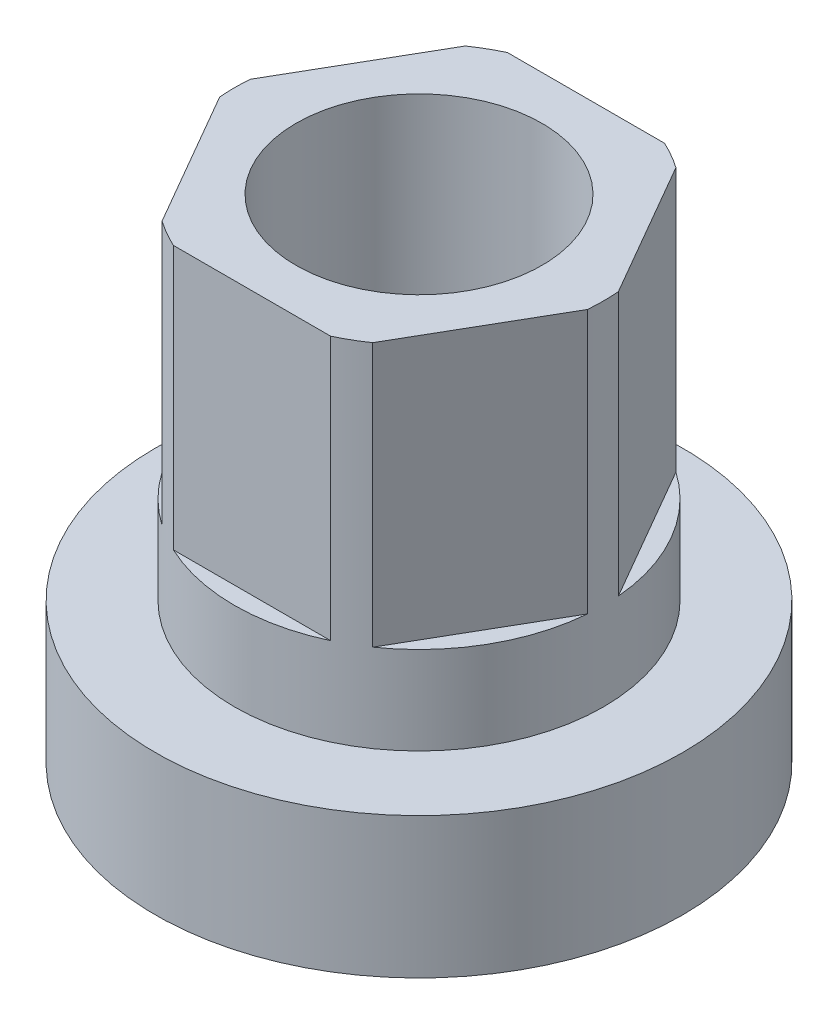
ISO-10303-21;
HEADER;
FILE_DESCRIPTION(('STEP AP214'),'2;1');
FILE_NAME('part.step','',(''),(''),'','','');
FILE_SCHEMA(('AUTOMOTIVE_DESIGN { 1 0 10303 214 1 1 1 1 }'));
ENDSEC;
DATA;
#1=APPLICATION_CONTEXT('core data for automotive mechanical design processes');
#2=APPLICATION_PROTOCOL_DEFINITION('international standard','automotive_design',2000,#1);
#3=PRODUCT_CONTEXT('',#1,'mechanical');
#4=PRODUCT('Part','Part','',(#3));
#5=PRODUCT_RELATED_PRODUCT_CATEGORY('part','',(#4));
#6=PRODUCT_DEFINITION_FORMATION('','',#4);
#7=PRODUCT_DEFINITION_CONTEXT('part definition',#1,'design');
#8=PRODUCT_DEFINITION('design','',#6,#7);
#9=PRODUCT_DEFINITION_SHAPE('','',#8);
#10=(LENGTH_UNIT() NAMED_UNIT(*) SI_UNIT(.MILLI.,.METRE.));
#11=(NAMED_UNIT(*) PLANE_ANGLE_UNIT() SI_UNIT($,.RADIAN.));
#12=(NAMED_UNIT(*) SI_UNIT($,.STERADIAN.) SOLID_ANGLE_UNIT());
#13=UNCERTAINTY_MEASURE_WITH_UNIT(LENGTH_MEASURE(1.E-05),#10,'distance_accuracy_value','');
#14=(GEOMETRIC_REPRESENTATION_CONTEXT(3) GLOBAL_UNCERTAINTY_ASSIGNED_CONTEXT((#13)) GLOBAL_UNIT_ASSIGNED_CONTEXT((#10,
#11,#12)) REPRESENTATION_CONTEXT('',''));
#15=CARTESIAN_POINT('',(0.,0.,0.));
#16=DIRECTION('',(0.,0.,1.));
#17=DIRECTION('',(1.,0.,0.));
#18=AXIS2_PLACEMENT_3D('',#15,#16,#17);
#19=CARTESIAN_POINT('',(7.00000000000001,28.,0.));
#20=DIRECTION('',(0.,-1.,0.));
#21=DIRECTION('',(1.,0.,0.));
#22=AXIS2_PLACEMENT_3D('',#19,#20,#21);
#23=PLANE('',#22);
#24=CARTESIAN_POINT('',(0.,28.,0.));
#25=DIRECTION('',(0.,1.,0.));
#26=DIRECTION('',(-1.,0.,0.));
#27=AXIS2_PLACEMENT_3D('',#24,#25,#26);
#28=CIRCLE('',#27,7.);
#29=CARTESIAN_POINT('',(-7.00000000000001,28.,0.));
#30=VERTEX_POINT('',#29);
#31=EDGE_CURVE('E183',#30,#30,#28,.T.);
#32=ORIENTED_EDGE('',*,*,#31,.F.);
#33=EDGE_LOOP('',(#32));
#34=FACE_BOUND('',#33,.T.);
#35=DIRECTION('',(1.,0.,0.));
#36=VECTOR('',#35,1.);
#37=CARTESIAN_POINT('',(-5.48482755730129,28.,9.50000000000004));
#38=LINE('',#37,#36);
#39=CARTESIAN_POINT('',(-4.47213595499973,28.,9.5000000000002));
#40=VERTEX_POINT('',#39);
#41=CARTESIAN_POINT('',(4.47213595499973,28.,9.50000000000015));
#42=VERTEX_POINT('',#41);
#43=EDGE_CURVE('E159',#40,#42,#38,.T.);
#44=ORIENTED_EDGE('',*,*,#43,.T.);
#45=CARTESIAN_POINT('',(0.,28.,0.));
#46=DIRECTION('',(0.,1.,0.));
#47=DIRECTION('',(-1.,0.,0.));
#48=AXIS2_PLACEMENT_3D('',#45,#46,#47);
#49=CIRCLE('',#48,10.5);
#50=CARTESIAN_POINT('',(5.99117335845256,28.,8.62298334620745));
#51=VERTEX_POINT('',#50);
#52=EDGE_CURVE('E157',#42,#51,#49,.T.);
#53=ORIENTED_EDGE('',*,*,#52,.T.);
#54=DIRECTION('',(0.500000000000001,0.,-0.86602540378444));
#55=VECTOR('',#54,1.);
#56=CARTESIAN_POINT('',(5.48482755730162,28.,9.50000000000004));
#57=LINE('',#56,#55);
#58=CARTESIAN_POINT('',(10.4633093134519,28.,0.877016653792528));
#59=VERTEX_POINT('',#58);
#60=EDGE_CURVE('E140',#51,#59,#57,.T.);
#61=ORIENTED_EDGE('',*,*,#60,.T.);
#62=CARTESIAN_POINT('',(10.4633093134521,28.,-0.877016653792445));
#63=VERTEX_POINT('',#62);
#64=EDGE_CURVE('E155',#59,#63,#49,.T.);
#65=ORIENTED_EDGE('',*,*,#64,.T.);
#66=DIRECTION('',(-0.500000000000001,0.,-0.86602540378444));
#67=VECTOR('',#66,1.);
#68=CARTESIAN_POINT('',(10.9696551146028,28.,0.));
#69=LINE('',#68,#67);
#70=CARTESIAN_POINT('',(5.99117335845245,28.,-8.62298334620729));
#71=VERTEX_POINT('',#70);
#72=EDGE_CURVE('E158',#63,#71,#69,.T.);
#73=ORIENTED_EDGE('',*,*,#72,.T.);
#74=CARTESIAN_POINT('',(4.47213595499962,28.,-9.50000000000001));
#75=VERTEX_POINT('',#74);
#76=EDGE_CURVE('E165',#71,#75,#49,.T.);
#77=ORIENTED_EDGE('',*,*,#76,.T.);
#78=DIRECTION('',(-1.,0.,0.));
#79=VECTOR('',#78,1.);
#80=CARTESIAN_POINT('',(5.48482755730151,28.,-9.50000000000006));
#81=LINE('',#80,#79);
#82=CARTESIAN_POINT('',(-4.47213595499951,28.,-9.50000000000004));
#83=VERTEX_POINT('',#82);
#84=EDGE_CURVE('E72',#75,#83,#81,.T.);
#85=ORIENTED_EDGE('',*,*,#84,.T.);
#86=CARTESIAN_POINT('',(-5.99117335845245,28.,-8.62298334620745));
#87=VERTEX_POINT('',#86);
#88=EDGE_CURVE('E169',#83,#87,#49,.T.);
#89=ORIENTED_EDGE('',*,*,#88,.T.);
#90=DIRECTION('',(-0.500000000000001,0.,0.86602540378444));
#91=VECTOR('',#90,1.);
#92=CARTESIAN_POINT('',(-5.48482755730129,28.,-9.4999999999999));
#93=LINE('',#92,#91);
#94=CARTESIAN_POINT('',(-10.4633093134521,28.,-0.877016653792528));
#95=VERTEX_POINT('',#94);
#96=EDGE_CURVE('E64',#87,#95,#93,.T.);
#97=ORIENTED_EDGE('',*,*,#96,.T.);
#98=CARTESIAN_POINT('',(-10.4633093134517,28.,0.877016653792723));
#99=VERTEX_POINT('',#98);
#100=EDGE_CURVE('E170',#95,#99,#49,.T.);
#101=ORIENTED_EDGE('',*,*,#100,.T.);
#102=DIRECTION('',(0.500000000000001,0.,0.86602540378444));
#103=VECTOR('',#102,1.);
#104=CARTESIAN_POINT('',(-10.9696551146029,28.,0.));
#105=LINE('',#104,#103);
#106=CARTESIAN_POINT('',(-5.99117335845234,28.,8.6229833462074));
#107=VERTEX_POINT('',#106);
#108=EDGE_CURVE('E175',#99,#107,#105,.T.);
#109=ORIENTED_EDGE('',*,*,#108,.T.);
#110=EDGE_CURVE('E167',#107,#40,#49,.T.);
#111=ORIENTED_EDGE('',*,*,#110,.T.);
#112=EDGE_LOOP('',(#44,#53,#61,#65,#73,#77,#85,#89,#97,#101,#109,#111));
#113=FACE_BOUND('',#112,.T.);
#114=ADVANCED_FACE('F49',(#34,#113),#23,.F.);
#115=CARTESIAN_POINT('',(0.,43.6484556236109,0.));
#116=DIRECTION('',(0.,1.,0.));
#117=DIRECTION('',(-1.,0.,0.));
#118=AXIS2_PLACEMENT_3D('',#115,#116,#117);
#119=CYLINDRICAL_SURFACE('',#118,10.5);
#120=CARTESIAN_POINT('',(0.,8.00000000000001,0.));
#121=DIRECTION('',(0.,1.,0.));
#122=DIRECTION('',(-1.,0.,0.));
#123=AXIS2_PLACEMENT_3D('',#120,#121,#122);
#124=CIRCLE('',#123,10.5);
#125=CARTESIAN_POINT('',(-10.5,8.00000000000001,0.));
#126=VERTEX_POINT('',#125);
#127=EDGE_CURVE('E180',#126,#126,#124,.T.);
#128=ORIENTED_EDGE('',*,*,#127,.T.);
#129=EDGE_LOOP('',(#128));
#130=FACE_BOUND('',#129,.T.);
#131=DIRECTION('',(0.,1.,0.));
#132=VECTOR('',#131,1.);
#133=CARTESIAN_POINT('',(4.47213595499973,43.6484556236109,9.50000000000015));
#134=LINE('',#133,#132);
#135=CARTESIAN_POINT('',(4.47213595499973,13.,9.50000000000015));
#136=VERTEX_POINT('',#135);
#137=EDGE_CURVE('E14',#136,#42,#134,.T.);
#138=ORIENTED_EDGE('',*,*,#137,.F.);
#139=CARTESIAN_POINT('',(0.,13.,0.));
#140=DIRECTION('',(0.,1.,0.));
#141=DIRECTION('',(-1.,0.,0.));
#142=AXIS2_PLACEMENT_3D('',#139,#140,#141);
#143=CIRCLE('',#142,10.5);
#144=CARTESIAN_POINT('',(-4.47213595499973,13.,9.5000000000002));
#145=VERTEX_POINT('',#144);
#146=EDGE_CURVE('E57',#145,#136,#143,.T.);
#147=ORIENTED_EDGE('',*,*,#146,.F.);
#148=DIRECTION('',(0.,1.,0.));
#149=VECTOR('',#148,1.);
#150=CARTESIAN_POINT('',(-4.47213595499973,43.6484556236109,9.50000000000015));
#151=LINE('',#150,#149);
#152=EDGE_CURVE('E213',#40,#145,#151,.F.);
#153=ORIENTED_EDGE('',*,*,#152,.F.);
#154=ORIENTED_EDGE('',*,*,#110,.F.);
#155=DIRECTION('',(0.,1.,0.));
#156=VECTOR('',#155,1.);
#157=CARTESIAN_POINT('',(-5.99117335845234,43.6484556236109,8.62298334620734));
#158=LINE('',#157,#156);
#159=CARTESIAN_POINT('',(-5.99117335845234,13.,8.6229833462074));
#160=VERTEX_POINT('',#159);
#161=EDGE_CURVE('E212',#160,#107,#158,.T.);
#162=ORIENTED_EDGE('',*,*,#161,.F.);
#163=CARTESIAN_POINT('',(-10.4633093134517,13.,0.877016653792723));
#164=VERTEX_POINT('',#163);
#165=EDGE_CURVE('E211',#164,#160,#143,.T.);
#166=ORIENTED_EDGE('',*,*,#165,.F.);
#167=DIRECTION('',(0.,1.,0.));
#168=VECTOR('',#167,1.);
#169=CARTESIAN_POINT('',(-10.4633093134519,43.6484556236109,0.877016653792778));
#170=LINE('',#169,#168);
#171=EDGE_CURVE('E209',#99,#164,#170,.F.);
#172=ORIENTED_EDGE('',*,*,#171,.F.);
#173=ORIENTED_EDGE('',*,*,#100,.F.);
#174=DIRECTION('',(0.,1.,0.));
#175=VECTOR('',#174,1.);
#176=CARTESIAN_POINT('',(-10.4633093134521,43.6484556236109,-0.877016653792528));
#177=LINE('',#176,#175);
#178=CARTESIAN_POINT('',(-10.4633093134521,13.,-0.877016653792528));
#179=VERTEX_POINT('',#178);
#180=EDGE_CURVE('E207',#179,#95,#177,.T.);
#181=ORIENTED_EDGE('',*,*,#180,.F.);
#182=CARTESIAN_POINT('',(-5.99117335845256,13.,-8.62298334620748));
#183=VERTEX_POINT('',#182);
#184=EDGE_CURVE('E206',#183,#179,#143,.T.);
#185=ORIENTED_EDGE('',*,*,#184,.F.);
#186=DIRECTION('',(0.,1.,0.));
#187=VECTOR('',#186,1.);
#188=CARTESIAN_POINT('',(-5.99117335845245,43.6484556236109,-8.62298334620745));
#189=LINE('',#188,#187);
#190=EDGE_CURVE('E204',#87,#183,#189,.F.);
#191=ORIENTED_EDGE('',*,*,#190,.F.);
#192=ORIENTED_EDGE('',*,*,#88,.F.);
#193=DIRECTION('',(0.,1.,0.));
#194=VECTOR('',#193,1.);
#195=CARTESIAN_POINT('',(-4.47213595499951,43.6484556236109,-9.50000000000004));
#196=LINE('',#195,#194);
#197=CARTESIAN_POINT('',(-4.47213595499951,13.,-9.50000000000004));
#198=VERTEX_POINT('',#197);
#199=EDGE_CURVE('E202',#198,#83,#196,.T.);
#200=ORIENTED_EDGE('',*,*,#199,.F.);
#201=CARTESIAN_POINT('',(4.47213595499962,13.,-9.50000000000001));
#202=VERTEX_POINT('',#201);
#203=EDGE_CURVE('E201',#202,#198,#143,.T.);
#204=ORIENTED_EDGE('',*,*,#203,.F.);
#205=DIRECTION('',(0.,1.,0.));
#206=VECTOR('',#205,1.);
#207=CARTESIAN_POINT('',(4.47213595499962,43.6484556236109,-9.50000000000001));
#208=LINE('',#207,#206);
#209=EDGE_CURVE('E199',#75,#202,#208,.F.);
#210=ORIENTED_EDGE('',*,*,#209,.F.);
#211=ORIENTED_EDGE('',*,*,#76,.F.);
#212=DIRECTION('',(0.,1.,0.));
#213=VECTOR('',#212,1.);
#214=CARTESIAN_POINT('',(5.99117335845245,43.6484556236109,-8.62298334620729));
#215=LINE('',#214,#213);
#216=CARTESIAN_POINT('',(5.99117335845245,13.,-8.62298334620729));
#217=VERTEX_POINT('',#216);
#218=EDGE_CURVE('E197',#217,#71,#215,.T.);
#219=ORIENTED_EDGE('',*,*,#218,.F.);
#220=CARTESIAN_POINT('',(10.4633093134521,13.,-0.877016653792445));
#221=VERTEX_POINT('',#220);
#222=EDGE_CURVE('E194',#221,#217,#143,.T.);
#223=ORIENTED_EDGE('',*,*,#222,.F.);
#224=DIRECTION('',(0.,1.,0.));
#225=VECTOR('',#224,1.);
#226=CARTESIAN_POINT('',(10.4633093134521,43.6484556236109,-0.877016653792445));
#227=LINE('',#226,#225);
#228=EDGE_CURVE('E147',#63,#221,#227,.F.);
#229=ORIENTED_EDGE('',*,*,#228,.F.);
#230=ORIENTED_EDGE('',*,*,#64,.F.);
#231=DIRECTION('',(0.,1.,0.));
#232=VECTOR('',#231,1.);
#233=CARTESIAN_POINT('',(10.4633093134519,43.6484556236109,0.877016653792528));
#234=LINE('',#233,#232);
#235=CARTESIAN_POINT('',(10.4633093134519,13.,0.877016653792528));
#236=VERTEX_POINT('',#235);
#237=EDGE_CURVE('E137',#236,#59,#234,.T.);
#238=ORIENTED_EDGE('',*,*,#237,.F.);
#239=CARTESIAN_POINT('',(5.99117335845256,13.,8.62298334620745));
#240=VERTEX_POINT('',#239);
#241=EDGE_CURVE('E148',#240,#236,#143,.T.);
#242=ORIENTED_EDGE('',*,*,#241,.F.);
#243=DIRECTION('',(0.,1.,0.));
#244=VECTOR('',#243,1.);
#245=CARTESIAN_POINT('',(5.99117335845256,43.6484556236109,8.62298334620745));
#246=LINE('',#245,#244);
#247=EDGE_CURVE('E192',#51,#240,#246,.F.);
#248=ORIENTED_EDGE('',*,*,#247,.F.);
#249=ORIENTED_EDGE('',*,*,#52,.F.);
#250=EDGE_LOOP('',(#138,#147,#153,#154,#162,#166,#172,#173,#181,#185,#191,#192,#200,#204,#210,
#211,#219,#223,#229,#230,#238,#242,#248,#249));
#251=FACE_BOUND('',#250,.T.);
#252=ADVANCED_FACE('F163',(#130,#251),#119,.T.);
#253=CARTESIAN_POINT('',(0.,66.1332339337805,0.));
#254=DIRECTION('',(0.,1.,0.));
#255=DIRECTION('',(-1.,0.,0.));
#256=AXIS2_PLACEMENT_3D('',#253,#254,#255);
#257=CYLINDRICAL_SURFACE('',#256,7.);
#258=CARTESIAN_POINT('',(0.,0.,0.));
#259=DIRECTION('',(0.,1.,0.));
#260=DIRECTION('',(-1.,0.,0.));
#261=AXIS2_PLACEMENT_3D('',#258,#259,#260);
#262=CIRCLE('',#261,7.);
#263=CARTESIAN_POINT('',(-7.00000000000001,0.,0.));
#264=VERTEX_POINT('',#263);
#265=EDGE_CURVE('E189',#264,#264,#262,.T.);
#266=ORIENTED_EDGE('',*,*,#265,.F.);
#267=EDGE_LOOP('',(#266));
#268=FACE_BOUND('',#267,.T.);
#269=ORIENTED_EDGE('',*,*,#31,.T.);
#270=EDGE_LOOP('',(#269));
#271=FACE_BOUND('',#270,.T.);
#272=ADVANCED_FACE('F51',(#268,#271),#257,.F.);
#273=CARTESIAN_POINT('',(7.00000000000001,0.,0.));
#274=DIRECTION('',(0.,1.,0.));
#275=DIRECTION('',(-1.,0.,0.));
#276=AXIS2_PLACEMENT_3D('',#273,#274,#275);
#277=PLANE('',#276);
#278=CARTESIAN_POINT('',(0.,0.,0.));
#279=DIRECTION('',(0.,1.,0.));
#280=DIRECTION('',(-1.,0.,0.));
#281=AXIS2_PLACEMENT_3D('',#278,#279,#280);
#282=CIRCLE('',#281,15.);
#283=CARTESIAN_POINT('',(-15.,0.,0.));
#284=VERTEX_POINT('',#283);
#285=EDGE_CURVE('E186',#284,#284,#282,.T.);
#286=ORIENTED_EDGE('',*,*,#285,.F.);
#287=EDGE_LOOP('',(#286));
#288=FACE_BOUND('',#287,.T.);
#289=ORIENTED_EDGE('',*,*,#265,.T.);
#290=EDGE_LOOP('',(#289));
#291=FACE_BOUND('',#290,.T.);
#292=ADVANCED_FACE('F291',(#288,#291),#277,.F.);
#293=CARTESIAN_POINT('',(0.,66.1332339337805,0.));
#294=DIRECTION('',(0.,1.,0.));
#295=DIRECTION('',(-1.,0.,0.));
#296=AXIS2_PLACEMENT_3D('',#293,#294,#295);
#297=CYLINDRICAL_SURFACE('',#296,15.);
#298=CARTESIAN_POINT('',(0.,8.00000000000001,0.));
#299=DIRECTION('',(0.,1.,0.));
#300=DIRECTION('',(-1.,0.,0.));
#301=AXIS2_PLACEMENT_3D('',#298,#299,#300);
#302=CIRCLE('',#301,15.);
#303=CARTESIAN_POINT('',(-15.,8.00000000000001,0.));
#304=VERTEX_POINT('',#303);
#305=EDGE_CURVE('E177',#304,#304,#302,.T.);
#306=ORIENTED_EDGE('',*,*,#305,.F.);
#307=EDGE_LOOP('',(#306));
#308=FACE_BOUND('',#307,.T.);
#309=ORIENTED_EDGE('',*,*,#285,.T.);
#310=EDGE_LOOP('',(#309));
#311=FACE_BOUND('',#310,.T.);
#312=ADVANCED_FACE('F289',(#308,#311),#297,.T.);
#313=CARTESIAN_POINT('',(-10.5,8.00000000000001,0.));
#314=DIRECTION('',(0.,-1.,0.));
#315=DIRECTION('',(1.,0.,0.));
#316=AXIS2_PLACEMENT_3D('',#313,#314,#315);
#317=PLANE('',#316);
#318=ORIENTED_EDGE('',*,*,#127,.F.);
#319=EDGE_LOOP('',(#318));
#320=FACE_BOUND('',#319,.T.);
#321=ORIENTED_EDGE('',*,*,#305,.T.);
#322=EDGE_LOOP('',(#321));
#323=FACE_BOUND('',#322,.T.);
#324=ADVANCED_FACE('F269',(#320,#323),#317,.F.);
#325=CARTESIAN_POINT('',(5.48482755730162,13.,9.50000000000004));
#326=DIRECTION('',(0.86602540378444,0.,0.500000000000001));
#327=DIRECTION('',(0.500000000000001,0.,-0.86602540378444));
#328=AXIS2_PLACEMENT_3D('',#325,#326,#327);
#329=PLANE('',#328);
#330=ORIENTED_EDGE('',*,*,#237,.T.);
#331=ORIENTED_EDGE('',*,*,#60,.F.);
#332=ORIENTED_EDGE('',*,*,#247,.T.);
#333=DIRECTION('',(0.500000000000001,0.,-0.86602540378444));
#334=VECTOR('',#333,1.);
#335=CARTESIAN_POINT('',(5.48482755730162,13.,9.50000000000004));
#336=LINE('',#335,#334);
#337=EDGE_CURVE('E143',#240,#236,#336,.T.);
#338=ORIENTED_EDGE('',*,*,#337,.T.);
#339=EDGE_LOOP('',(#330,#331,#332,#338));
#340=FACE_BOUND('',#339,.T.);
#341=ADVANCED_FACE('F139',(#340),#329,.T.);
#342=CARTESIAN_POINT('',(0.,13.,0.));
#343=DIRECTION('',(0.,1.,0.));
#344=DIRECTION('',(-1.,0.,0.));
#345=AXIS2_PLACEMENT_3D('',#342,#343,#344);
#346=PLANE('',#345);
#347=ORIENTED_EDGE('',*,*,#241,.T.);
#348=ORIENTED_EDGE('',*,*,#337,.F.);
#349=EDGE_LOOP('',(#347,#348));
#350=FACE_BOUND('',#349,.T.);
#351=ADVANCED_FACE('F260',(#350),#346,.T.);
#352=CARTESIAN_POINT('',(10.9696551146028,13.,0.));
#353=DIRECTION('',(0.86602540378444,0.,-0.500000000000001));
#354=DIRECTION('',(-0.500000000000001,0.,-0.86602540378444));
#355=AXIS2_PLACEMENT_3D('',#352,#353,#354);
#356=PLANE('',#355);
#357=ORIENTED_EDGE('',*,*,#218,.T.);
#358=ORIENTED_EDGE('',*,*,#72,.F.);
#359=ORIENTED_EDGE('',*,*,#228,.T.);
#360=DIRECTION('',(-0.500000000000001,0.,-0.86602540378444));
#361=VECTOR('',#360,1.);
#362=CARTESIAN_POINT('',(10.9696551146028,13.,0.));
#363=LINE('',#362,#361);
#364=EDGE_CURVE('E236',#221,#217,#363,.T.);
#365=ORIENTED_EDGE('',*,*,#364,.T.);
#366=EDGE_LOOP('',(#357,#358,#359,#365));
#367=FACE_BOUND('',#366,.T.);
#368=ADVANCED_FACE('F239',(#367),#356,.T.);
#369=ORIENTED_EDGE('',*,*,#222,.T.);
#370=ORIENTED_EDGE('',*,*,#364,.F.);
#371=EDGE_LOOP('',(#369,#370));
#372=FACE_BOUND('',#371,.T.);
#373=ADVANCED_FACE('F235',(#372),#346,.T.);
#374=CARTESIAN_POINT('',(5.48482755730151,13.,-9.50000000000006));
#375=DIRECTION('',(0.,0.,-1.));
#376=DIRECTION('',(-1.,0.,0.));
#377=AXIS2_PLACEMENT_3D('',#374,#375,#376);
#378=PLANE('',#377);
#379=ORIENTED_EDGE('',*,*,#199,.T.);
#380=ORIENTED_EDGE('',*,*,#84,.F.);
#381=ORIENTED_EDGE('',*,*,#209,.T.);
#382=DIRECTION('',(-1.,0.,0.));
#383=VECTOR('',#382,1.);
#384=CARTESIAN_POINT('',(5.48482755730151,13.,-9.50000000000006));
#385=LINE('',#384,#383);
#386=EDGE_CURVE('E240',#202,#198,#385,.T.);
#387=ORIENTED_EDGE('',*,*,#386,.T.);
#388=EDGE_LOOP('',(#379,#380,#381,#387));
#389=FACE_BOUND('',#388,.T.);
#390=ADVANCED_FACE('F275',(#389),#378,.T.);
#391=ORIENTED_EDGE('',*,*,#203,.T.);
#392=ORIENTED_EDGE('',*,*,#386,.F.);
#393=EDGE_LOOP('',(#391,#392));
#394=FACE_BOUND('',#393,.T.);
#395=ADVANCED_FACE('F276',(#394),#346,.T.);
#396=CARTESIAN_POINT('',(-5.48482755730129,13.,-9.4999999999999));
#397=DIRECTION('',(-0.86602540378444,0.,-0.500000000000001));
#398=DIRECTION('',(-0.500000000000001,0.,0.86602540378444));
#399=AXIS2_PLACEMENT_3D('',#396,#397,#398);
#400=PLANE('',#399);
#401=ORIENTED_EDGE('',*,*,#180,.T.);
#402=ORIENTED_EDGE('',*,*,#96,.F.);
#403=ORIENTED_EDGE('',*,*,#190,.T.);
#404=DIRECTION('',(-0.500000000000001,0.,0.86602540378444));
#405=VECTOR('',#404,1.);
#406=CARTESIAN_POINT('',(-5.48482755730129,13.,-9.4999999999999));
#407=LINE('',#406,#405);
#408=EDGE_CURVE('E257',#183,#179,#407,.T.);
#409=ORIENTED_EDGE('',*,*,#408,.T.);
#410=EDGE_LOOP('',(#401,#402,#403,#409));
#411=FACE_BOUND('',#410,.T.);
#412=ADVANCED_FACE('F344',(#411),#400,.T.);
#413=ORIENTED_EDGE('',*,*,#184,.T.);
#414=ORIENTED_EDGE('',*,*,#408,.F.);
#415=EDGE_LOOP('',(#413,#414));
#416=FACE_BOUND('',#415,.T.);
#417=ADVANCED_FACE('F345',(#416),#346,.T.);
#418=CARTESIAN_POINT('',(-10.9696551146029,13.,0.));
#419=DIRECTION('',(-0.86602540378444,0.,0.500000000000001));
#420=DIRECTION('',(0.500000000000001,0.,0.86602540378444));
#421=AXIS2_PLACEMENT_3D('',#418,#419,#420);
#422=PLANE('',#421);
#423=ORIENTED_EDGE('',*,*,#161,.T.);
#424=ORIENTED_EDGE('',*,*,#108,.F.);
#425=ORIENTED_EDGE('',*,*,#171,.T.);
#426=DIRECTION('',(0.500000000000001,0.,0.86602540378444));
#427=VECTOR('',#426,1.);
#428=CARTESIAN_POINT('',(-10.9696551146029,13.,0.));
#429=LINE('',#428,#427);
#430=EDGE_CURVE('E174',#164,#160,#429,.T.);
#431=ORIENTED_EDGE('',*,*,#430,.T.);
#432=EDGE_LOOP('',(#423,#424,#425,#431));
#433=FACE_BOUND('',#432,.T.);
#434=ADVANCED_FACE('F357',(#433),#422,.T.);
#435=ORIENTED_EDGE('',*,*,#165,.T.);
#436=ORIENTED_EDGE('',*,*,#430,.F.);
#437=EDGE_LOOP('',(#435,#436));
#438=FACE_BOUND('',#437,.T.);
#439=ADVANCED_FACE('F271',(#438),#346,.T.);
#440=ORIENTED_EDGE('',*,*,#146,.T.);
#441=DIRECTION('',(1.,0.,0.));
#442=VECTOR('',#441,1.);
#443=CARTESIAN_POINT('',(-5.48482755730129,13.,9.50000000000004));
#444=LINE('',#443,#442);
#445=EDGE_CURVE('E250',#145,#136,#444,.T.);
#446=ORIENTED_EDGE('',*,*,#445,.F.);
#447=EDGE_LOOP('',(#440,#446));
#448=FACE_BOUND('',#447,.T.);
#449=ADVANCED_FACE('F263',(#448),#346,.T.);
#450=CARTESIAN_POINT('',(-5.48482755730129,13.,9.50000000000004));
#451=DIRECTION('',(0.,0.,1.));
#452=DIRECTION('',(1.,0.,0.));
#453=AXIS2_PLACEMENT_3D('',#450,#451,#452);
#454=PLANE('',#453);
#455=ORIENTED_EDGE('',*,*,#137,.T.);
#456=ORIENTED_EDGE('',*,*,#43,.F.);
#457=ORIENTED_EDGE('',*,*,#152,.T.);
#458=ORIENTED_EDGE('',*,*,#445,.T.);
#459=EDGE_LOOP('',(#455,#456,#457,#458));
#460=FACE_BOUND('',#459,.T.);
#461=ADVANCED_FACE('F278',(#460),#454,.T.);
#462=CLOSED_SHELL('',(#114,#252,#272,#292,#312,#324,#341,#351,#368,#373,#390,#395,#412,#417,
#434,#439,#449,#461));
#463=MANIFOLD_SOLID_BREP('B2',#462);
#464=ADVANCED_BREP_SHAPE_REPRESENTATION('',(#18,#463),#14);
#465=SHAPE_DEFINITION_REPRESENTATION(#9,#464);
ENDSEC;
END-ISO-10303-21;
